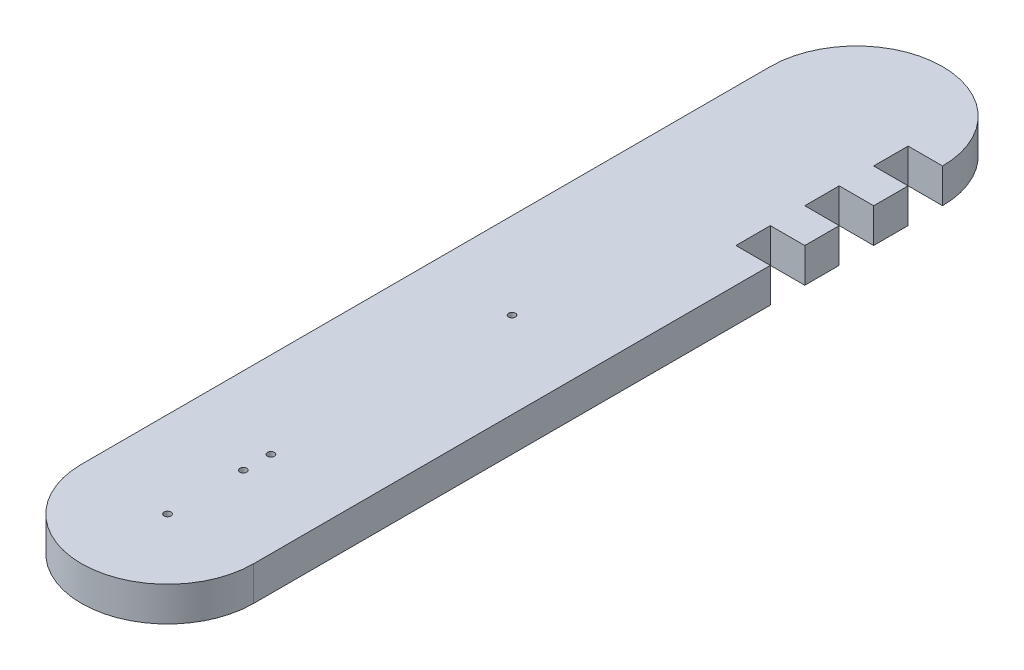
from build123d import *

# Parameters (mm, degrees)
SKETCH1_R           = 0.5
BOSS_EXTRUDE1_DEPTH = 5
SKETCH2_W           = 5
SKETCH2_H           = 5
CUT_EXTRUDE1_DEPTH  = 5


with BuildPart() as part:
    # Sketch1 → Boss-Extrude1 (new body)
    with BuildSketch(Plane(origin=(0, 0, 0), x_dir=(1, 0, 0), z_dir=(0, 1, 0))):
        with BuildLine():
            Line((0, 0), (0, -100))
            ThreePointArc((0, -100), (12.5, -112.5), (25, -100))
            Line((25, -100), (25, 0))
            ThreePointArc((25, 0), (12.5, 12.5), (0, 0))
        make_face()
        with Locations(Location((12.5, -100, 0), (0, 0, 270))):
            Circle(SKETCH1_R, mode=Mode.SUBTRACT)
        with Locations(Location((12.5, -89, 0), (0, 0, 270))):
            Circle(SKETCH1_R, mode=Mode.SUBTRACT)
        with Locations(Location((12.5, -85, 0), (0, 0, 270))):
            Circle(SKETCH1_R, mode=Mode.SUBTRACT)
        with Locations(Location((12.5, -50, 0), (0, 0, 270))):
            Circle(SKETCH1_R, mode=Mode.SUBTRACT)
    extrude(amount=BOSS_EXTRUDE1_DEPTH)

    # Sketch2 → Cut-Extrude1 (cut)
    with BuildSketch(Plane(origin=(0, 5, 0), x_dir=(1, 0, 0), z_dir=(0, 1, 0))):
        with Locations((22.5, -2.5)):
            Rectangle(SKETCH2_W, SKETCH2_H)
        with Locations((22.5, -12.5)):
            Rectangle(SKETCH2_W, SKETCH2_H)
        with Locations((22.5, -22.5)):
            Rectangle(SKETCH2_W, SKETCH2_H)
    extrude(amount=-CUT_EXTRUDE1_DEPTH, mode=Mode.SUBTRACT)


solid = part.part
